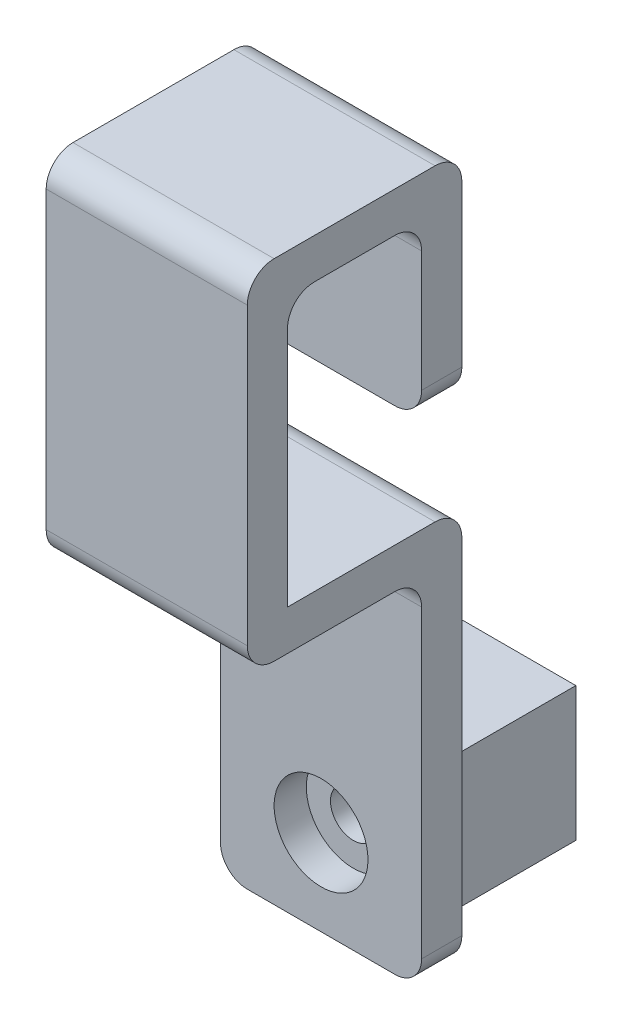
ISO-10303-21;
HEADER;
FILE_DESCRIPTION(('STEP AP214'),'2;1');
FILE_NAME('part.step','',(''),(''),'','','');
FILE_SCHEMA(('AUTOMOTIVE_DESIGN { 1 0 10303 214 1 1 1 1 }'));
ENDSEC;
DATA;
#1=APPLICATION_CONTEXT('core data for automotive mechanical design processes');
#2=APPLICATION_PROTOCOL_DEFINITION('international standard','automotive_design',2000,#1);
#3=PRODUCT_CONTEXT('',#1,'mechanical');
#4=PRODUCT('Part','Part','',(#3));
#5=PRODUCT_RELATED_PRODUCT_CATEGORY('part','',(#4));
#6=PRODUCT_DEFINITION_FORMATION('','',#4);
#7=PRODUCT_DEFINITION_CONTEXT('part definition',#1,'design');
#8=PRODUCT_DEFINITION('design','',#6,#7);
#9=PRODUCT_DEFINITION_SHAPE('','',#8);
#10=(LENGTH_UNIT() NAMED_UNIT(*) SI_UNIT(.MILLI.,.METRE.));
#11=(NAMED_UNIT(*) PLANE_ANGLE_UNIT() SI_UNIT($,.RADIAN.));
#12=(NAMED_UNIT(*) SI_UNIT($,.STERADIAN.) SOLID_ANGLE_UNIT());
#13=UNCERTAINTY_MEASURE_WITH_UNIT(LENGTH_MEASURE(1.E-05),#10,'distance_accuracy_value','');
#14=(GEOMETRIC_REPRESENTATION_CONTEXT(3) GLOBAL_UNCERTAINTY_ASSIGNED_CONTEXT((#13)) GLOBAL_UNIT_ASSIGNED_CONTEXT((#10,
#11,#12)) REPRESENTATION_CONTEXT('',''));
#15=CARTESIAN_POINT('',(0.,0.,0.));
#16=DIRECTION('',(0.,0.,1.));
#17=DIRECTION('',(1.,0.,0.));
#18=AXIS2_PLACEMENT_3D('',#15,#16,#17);
#19=CARTESIAN_POINT('',(7.49999999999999,43.3205159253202,11.));
#20=DIRECTION('',(0.,1.,0.));
#21=DIRECTION('',(0.,0.,1.));
#22=AXIS2_PLACEMENT_3D('',#19,#20,#21);
#23=PLANE('',#22);
#24=DIRECTION('',(0.,0.,1.));
#25=VECTOR('',#24,1.);
#26=CARTESIAN_POINT('',(7.49999999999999,43.3205159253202,11.));
#27=LINE('',#26,#25);
#28=CARTESIAN_POINT('',(7.49999999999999,43.3205159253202,16.));
#29=VERTEX_POINT('',#28);
#30=CARTESIAN_POINT('',(7.49999999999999,43.3205159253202,22.));
#31=VERTEX_POINT('',#30);
#32=EDGE_CURVE('E235',#29,#31,#27,.T.);
#33=ORIENTED_EDGE('',*,*,#32,.T.);
#34=DIRECTION('',(-1.,0.,0.));
#35=VECTOR('',#34,1.);
#36=CARTESIAN_POINT('',(-7.50000000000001,43.3205159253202,22.));
#37=LINE('',#36,#35);
#38=CARTESIAN_POINT('',(-7.50000000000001,43.3205159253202,22.));
#39=VERTEX_POINT('',#38);
#40=EDGE_CURVE('E322',#31,#39,#37,.T.);
#41=ORIENTED_EDGE('',*,*,#40,.T.);
#42=DIRECTION('',(0.,0.,1.));
#43=VECTOR('',#42,1.);
#44=CARTESIAN_POINT('',(-7.50000000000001,43.3205159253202,11.));
#45=LINE('',#44,#43);
#46=CARTESIAN_POINT('',(-7.50000000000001,43.3205159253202,16.));
#47=VERTEX_POINT('',#46);
#48=EDGE_CURVE('E378',#47,#39,#45,.T.);
#49=ORIENTED_EDGE('',*,*,#48,.F.);
#50=DIRECTION('',(-1.,0.,0.));
#51=VECTOR('',#50,1.);
#52=CARTESIAN_POINT('',(7.49999999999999,43.3205159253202,16.));
#53=LINE('',#52,#51);
#54=EDGE_CURVE('E320',#47,#29,#53,.F.);
#55=ORIENTED_EDGE('',*,*,#54,.T.);
#56=EDGE_LOOP('',(#33,#41,#49,#55));
#57=FACE_BOUND('',#56,.T.);
#58=ADVANCED_FACE('F35',(#57),#23,.F.);
#59=CARTESIAN_POINT('',(7.49999999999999,46.3205159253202,24.));
#60=DIRECTION('',(0.,0.,1.));
#61=DIRECTION('',(1.,0.,0.));
#62=AXIS2_PLACEMENT_3D('',#59,#60,#61);
#63=PLANE('',#62);
#64=DIRECTION('',(0.,-1.,0.));
#65=VECTOR('',#64,1.);
#66=CARTESIAN_POINT('',(-7.50000000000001,46.3205159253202,24.));
#67=LINE('',#66,#65);
#68=CARTESIAN_POINT('',(-7.50000000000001,41.3205159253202,24.));
#69=VERTEX_POINT('',#68);
#70=CARTESIAN_POINT('',(-7.50000000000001,23.3205159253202,24.));
#71=VERTEX_POINT('',#70);
#72=EDGE_CURVE('E226',#69,#71,#67,.T.);
#73=ORIENTED_EDGE('',*,*,#72,.F.);
#74=DIRECTION('',(-1.,0.,0.));
#75=VECTOR('',#74,1.);
#76=CARTESIAN_POINT('',(7.49999999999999,41.3205159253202,24.));
#77=LINE('',#76,#75);
#78=CARTESIAN_POINT('',(7.49999999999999,41.3205159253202,24.));
#79=VERTEX_POINT('',#78);
#80=EDGE_CURVE('E222',#69,#79,#77,.F.);
#81=ORIENTED_EDGE('',*,*,#80,.T.);
#82=DIRECTION('',(0.,-1.,0.));
#83=VECTOR('',#82,1.);
#84=CARTESIAN_POINT('',(7.49999999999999,46.3205159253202,24.));
#85=LINE('',#84,#83);
#86=CARTESIAN_POINT('',(7.49999999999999,23.3205159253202,24.));
#87=VERTEX_POINT('',#86);
#88=EDGE_CURVE('E215',#79,#87,#85,.T.);
#89=ORIENTED_EDGE('',*,*,#88,.T.);
#90=DIRECTION('',(-1.,0.,0.));
#91=VECTOR('',#90,1.);
#92=CARTESIAN_POINT('',(7.49999999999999,23.3205159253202,24.));
#93=LINE('',#92,#91);
#94=EDGE_CURVE('E219',#87,#71,#93,.T.);
#95=ORIENTED_EDGE('',*,*,#94,.T.);
#96=EDGE_LOOP('',(#73,#81,#89,#95));
#97=FACE_BOUND('',#96,.T.);
#98=ADVANCED_FACE('F218',(#97),#63,.F.);
#99=CARTESIAN_POINT('',(-7.50000000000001,23.3205159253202,14.));
#100=DIRECTION('',(0.,-1.,0.));
#101=DIRECTION('',(0.,0.,-1.));
#102=AXIS2_PLACEMENT_3D('',#99,#100,#101);
#103=PLANE('',#102);
#104=ORIENTED_EDGE('',*,*,#94,.F.);
#105=DIRECTION('',(0.,0.,-1.));
#106=VECTOR('',#105,1.);
#107=CARTESIAN_POINT('',(7.49999999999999,23.3205159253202,14.));
#108=LINE('',#107,#106);
#109=CARTESIAN_POINT('',(7.49999999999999,23.3205159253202,13.));
#110=VERTEX_POINT('',#109);
#111=EDGE_CURVE('E231',#87,#110,#108,.T.);
#112=ORIENTED_EDGE('',*,*,#111,.T.);
#113=DIRECTION('',(-1.,0.,0.));
#114=VECTOR('',#113,1.);
#115=CARTESIAN_POINT('',(-7.50000000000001,23.3205159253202,13.));
#116=LINE('',#115,#114);
#117=CARTESIAN_POINT('',(-7.50000000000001,23.3205159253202,13.));
#118=VERTEX_POINT('',#117);
#119=EDGE_CURVE('E418',#110,#118,#116,.T.);
#120=ORIENTED_EDGE('',*,*,#119,.T.);
#121=DIRECTION('',(0.,0.,-1.));
#122=VECTOR('',#121,1.);
#123=CARTESIAN_POINT('',(-7.50000000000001,23.3205159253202,14.));
#124=LINE('',#123,#122);
#125=EDGE_CURVE('E233',#71,#118,#124,.T.);
#126=ORIENTED_EDGE('',*,*,#125,.F.);
#127=EDGE_LOOP('',(#104,#112,#120,#126));
#128=FACE_BOUND('',#127,.T.);
#129=ADVANCED_FACE('F229',(#128),#103,.F.);
#130=CARTESIAN_POINT('',(0.,0.,14.));
#131=DIRECTION('',(0.,0.,-1.));
#132=DIRECTION('',(-1.,0.,0.));
#133=AXIS2_PLACEMENT_3D('',#130,#131,#132);
#134=PLANE('',#133);
#135=DIRECTION('',(0.,1.,0.));
#136=VECTOR('',#135,1.);
#137=CARTESIAN_POINT('',(7.5,-6.40117873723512,14.));
#138=LINE('',#137,#136);
#139=CARTESIAN_POINT('',(7.5,-4.40117873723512,14.));
#140=VERTEX_POINT('',#139);
#141=CARTESIAN_POINT('',(7.5,18.3205159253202,14.));
#142=VERTEX_POINT('',#141);
#143=EDGE_CURVE('E247',#140,#142,#138,.T.);
#144=ORIENTED_EDGE('',*,*,#143,.T.);
#145=DIRECTION('',(1.,0.,0.));
#146=VECTOR('',#145,1.);
#147=CARTESIAN_POINT('',(-7.50000000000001,18.3205159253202,14.));
#148=LINE('',#147,#146);
#149=CARTESIAN_POINT('',(-7.5,18.3205159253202,14.));
#150=VERTEX_POINT('',#149);
#151=EDGE_CURVE('E416',#142,#150,#148,.F.);
#152=ORIENTED_EDGE('',*,*,#151,.T.);
#153=DIRECTION('',(0.,-1.,0.));
#154=VECTOR('',#153,1.);
#155=CARTESIAN_POINT('',(-7.5,-6.40117873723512,14.));
#156=LINE('',#155,#154);
#157=CARTESIAN_POINT('',(-7.5,-4.40117873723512,14.));
#158=VERTEX_POINT('',#157);
#159=EDGE_CURVE('E410',#150,#158,#156,.T.);
#160=ORIENTED_EDGE('',*,*,#159,.T.);
#161=CARTESIAN_POINT('',(-5.5,-4.40117873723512,14.));
#162=DIRECTION('',(0.,0.,-1.));
#163=DIRECTION('',(-1.,0.,0.));
#164=AXIS2_PLACEMENT_3D('',#161,#162,#163);
#165=CIRCLE('',#164,2.);
#166=CARTESIAN_POINT('',(-5.5,-6.40117873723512,14.));
#167=VERTEX_POINT('',#166);
#168=EDGE_CURVE('E466',#158,#167,#165,.F.);
#169=ORIENTED_EDGE('',*,*,#168,.T.);
#170=DIRECTION('',(1.,0.,0.));
#171=VECTOR('',#170,1.);
#172=CARTESIAN_POINT('',(-7.5,-6.40117873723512,14.));
#173=LINE('',#172,#171);
#174=CARTESIAN_POINT('',(5.5,-6.40117873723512,14.));
#175=VERTEX_POINT('',#174);
#176=EDGE_CURVE('E407',#167,#175,#173,.T.);
#177=ORIENTED_EDGE('',*,*,#176,.T.);
#178=CARTESIAN_POINT('',(5.5,-4.40117873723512,14.));
#179=DIRECTION('',(0.,0.,-1.));
#180=DIRECTION('',(-1.,0.,0.));
#181=AXIS2_PLACEMENT_3D('',#178,#179,#180);
#182=CIRCLE('',#181,2.);
#183=EDGE_CURVE('E470',#175,#140,#182,.F.);
#184=ORIENTED_EDGE('',*,*,#183,.T.);
#185=EDGE_LOOP('',(#144,#152,#160,#169,#177,#184));
#186=FACE_BOUND('',#185,.T.);
#187=CARTESIAN_POINT('',(0.,0.,14.));
#188=DIRECTION('',(0.,0.,1.));
#189=DIRECTION('',(1.,0.,0.));
#190=AXIS2_PLACEMENT_3D('',#187,#188,#189);
#191=CIRCLE('',#190,3.5);
#192=CARTESIAN_POINT('',(3.5,0.,14.));
#193=VERTEX_POINT('',#192);
#194=EDGE_CURVE('E225',#193,#193,#191,.T.);
#195=ORIENTED_EDGE('',*,*,#194,.F.);
#196=EDGE_LOOP('',(#195));
#197=FACE_BOUND('',#196,.T.);
#198=ADVANCED_FACE('F505',(#186,#197),#134,.F.);
#199=CARTESIAN_POINT('',(5.,5.,11.));
#200=DIRECTION('',(-1.,0.,0.));
#201=DIRECTION('',(0.,-1.,0.));
#202=AXIS2_PLACEMENT_3D('',#199,#200,#201);
#203=PLANE('',#202);
#204=DIRECTION('',(0.,1.,0.));
#205=VECTOR('',#204,1.);
#206=CARTESIAN_POINT('',(5.,5.,0.));
#207=LINE('',#206,#205);
#208=CARTESIAN_POINT('',(5.,-5.,0.));
#209=VERTEX_POINT('',#208);
#210=CARTESIAN_POINT('',(5.,5.,0.));
#211=VERTEX_POINT('',#210);
#212=EDGE_CURVE('E242',#209,#211,#207,.T.);
#213=ORIENTED_EDGE('',*,*,#212,.T.);
#214=DIRECTION('',(0.,0.,-1.));
#215=VECTOR('',#214,1.);
#216=CARTESIAN_POINT('',(5.,5.,11.));
#217=LINE('',#216,#215);
#218=CARTESIAN_POINT('',(5.,5.,11.));
#219=VERTEX_POINT('',#218);
#220=EDGE_CURVE('E277',#219,#211,#217,.T.);
#221=ORIENTED_EDGE('',*,*,#220,.F.);
#222=DIRECTION('',(0.,1.,0.));
#223=VECTOR('',#222,1.);
#224=CARTESIAN_POINT('',(5.,5.,11.));
#225=LINE('',#224,#223);
#226=CARTESIAN_POINT('',(5.,-5.,11.));
#227=VERTEX_POINT('',#226);
#228=EDGE_CURVE('E251',#227,#219,#225,.T.);
#229=ORIENTED_EDGE('',*,*,#228,.F.);
#230=DIRECTION('',(0.,0.,-1.));
#231=VECTOR('',#230,1.);
#232=CARTESIAN_POINT('',(5.,-5.,11.));
#233=LINE('',#232,#231);
#234=EDGE_CURVE('E263',#227,#209,#233,.T.);
#235=ORIENTED_EDGE('',*,*,#234,.T.);
#236=EDGE_LOOP('',(#213,#221,#229,#235));
#237=FACE_BOUND('',#236,.T.);
#238=ADVANCED_FACE('F559',(#237),#203,.F.);
#239=CARTESIAN_POINT('',(-5.,5.,11.));
#240=DIRECTION('',(0.,-1.,0.));
#241=DIRECTION('',(0.,0.,-1.));
#242=AXIS2_PLACEMENT_3D('',#239,#240,#241);
#243=PLANE('',#242);
#244=DIRECTION('',(-1.,0.,0.));
#245=VECTOR('',#244,1.);
#246=CARTESIAN_POINT('',(-5.,5.,0.));
#247=LINE('',#246,#245);
#248=CARTESIAN_POINT('',(-5.,5.,0.));
#249=VERTEX_POINT('',#248);
#250=EDGE_CURVE('E245',#211,#249,#247,.T.);
#251=ORIENTED_EDGE('',*,*,#250,.T.);
#252=DIRECTION('',(0.,0.,-1.));
#253=VECTOR('',#252,1.);
#254=CARTESIAN_POINT('',(-5.,5.,11.));
#255=LINE('',#254,#253);
#256=CARTESIAN_POINT('',(-5.,5.,11.));
#257=VERTEX_POINT('',#256);
#258=EDGE_CURVE('E274',#257,#249,#255,.T.);
#259=ORIENTED_EDGE('',*,*,#258,.F.);
#260=DIRECTION('',(-1.,0.,0.));
#261=VECTOR('',#260,1.);
#262=CARTESIAN_POINT('',(-5.,5.,11.));
#263=LINE('',#262,#261);
#264=EDGE_CURVE('E254',#219,#257,#263,.T.);
#265=ORIENTED_EDGE('',*,*,#264,.F.);
#266=ORIENTED_EDGE('',*,*,#220,.T.);
#267=EDGE_LOOP('',(#251,#259,#265,#266));
#268=FACE_BOUND('',#267,.T.);
#269=ADVANCED_FACE('F718',(#268),#243,.F.);
#270=CARTESIAN_POINT('',(-5.,5.,11.));
#271=DIRECTION('',(1.,0.,0.));
#272=DIRECTION('',(0.,0.,-1.));
#273=AXIS2_PLACEMENT_3D('',#270,#271,#272);
#274=PLANE('',#273);
#275=DIRECTION('',(0.,-1.,0.));
#276=VECTOR('',#275,1.);
#277=CARTESIAN_POINT('',(-5.,5.,0.));
#278=LINE('',#277,#276);
#279=CARTESIAN_POINT('',(-5.,-5.,0.));
#280=VERTEX_POINT('',#279);
#281=EDGE_CURVE('E266',#249,#280,#278,.T.);
#282=ORIENTED_EDGE('',*,*,#281,.T.);
#283=DIRECTION('',(0.,0.,-1.));
#284=VECTOR('',#283,1.);
#285=CARTESIAN_POINT('',(-5.,-5.,11.));
#286=LINE('',#285,#284);
#287=CARTESIAN_POINT('',(-5.,-5.,11.));
#288=VERTEX_POINT('',#287);
#289=EDGE_CURVE('E271',#288,#280,#286,.T.);
#290=ORIENTED_EDGE('',*,*,#289,.F.);
#291=DIRECTION('',(0.,-1.,0.));
#292=VECTOR('',#291,1.);
#293=CARTESIAN_POINT('',(-5.,5.,11.));
#294=LINE('',#293,#292);
#295=EDGE_CURVE('E258',#257,#288,#294,.T.);
#296=ORIENTED_EDGE('',*,*,#295,.F.);
#297=ORIENTED_EDGE('',*,*,#258,.T.);
#298=EDGE_LOOP('',(#282,#290,#296,#297));
#299=FACE_BOUND('',#298,.T.);
#300=ADVANCED_FACE('F722',(#299),#274,.F.);
#301=CARTESIAN_POINT('',(-5.,-5.,11.));
#302=DIRECTION('',(0.,1.,0.));
#303=DIRECTION('',(0.,0.,1.));
#304=AXIS2_PLACEMENT_3D('',#301,#302,#303);
#305=PLANE('',#304);
#306=DIRECTION('',(1.,0.,0.));
#307=VECTOR('',#306,1.);
#308=CARTESIAN_POINT('',(-5.,-5.,0.));
#309=LINE('',#308,#307);
#310=EDGE_CURVE('E255',#280,#209,#309,.T.);
#311=ORIENTED_EDGE('',*,*,#310,.T.);
#312=ORIENTED_EDGE('',*,*,#234,.F.);
#313=DIRECTION('',(1.,0.,0.));
#314=VECTOR('',#313,1.);
#315=CARTESIAN_POINT('',(-5.,-5.,11.));
#316=LINE('',#315,#314);
#317=EDGE_CURVE('E261',#288,#227,#316,.T.);
#318=ORIENTED_EDGE('',*,*,#317,.F.);
#319=ORIENTED_EDGE('',*,*,#289,.T.);
#320=EDGE_LOOP('',(#311,#312,#318,#319));
#321=FACE_BOUND('',#320,.T.);
#322=ADVANCED_FACE('F726',(#321),#305,.F.);
#323=CARTESIAN_POINT('',(0.,0.,0.));
#324=DIRECTION('',(0.,0.,1.));
#325=DIRECTION('',(1.,0.,0.));
#326=AXIS2_PLACEMENT_3D('',#323,#324,#325);
#327=PLANE('',#326);
#328=CARTESIAN_POINT('',(0.,0.,0.));
#329=DIRECTION('',(0.,0.,1.));
#330=DIRECTION('',(1.,0.,0.));
#331=AXIS2_PLACEMENT_3D('',#328,#329,#330);
#332=CIRCLE('',#331,1.7);
#333=CARTESIAN_POINT('',(1.7,0.,0.));
#334=VERTEX_POINT('',#333);
#335=EDGE_CURVE('E397',#334,#334,#332,.T.);
#336=ORIENTED_EDGE('',*,*,#335,.T.);
#337=EDGE_LOOP('',(#336));
#338=FACE_BOUND('',#337,.T.);
#339=ORIENTED_EDGE('',*,*,#212,.F.);
#340=ORIENTED_EDGE('',*,*,#310,.F.);
#341=ORIENTED_EDGE('',*,*,#281,.F.);
#342=ORIENTED_EDGE('',*,*,#250,.F.);
#343=EDGE_LOOP('',(#339,#340,#341,#342));
#344=FACE_BOUND('',#343,.T.);
#345=ADVANCED_FACE('F562',(#338,#344),#327,.F.);
#346=CARTESIAN_POINT('',(0.,0.,11.));
#347=DIRECTION('',(0.,0.,-1.));
#348=DIRECTION('',(-1.,0.,0.));
#349=AXIS2_PLACEMENT_3D('',#346,#347,#348);
#350=PLANE('',#349);
#351=DIRECTION('',(0.,-1.,0.));
#352=VECTOR('',#351,1.);
#353=CARTESIAN_POINT('',(-7.5,-6.40117873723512,11.));
#354=LINE('',#353,#352);
#355=CARTESIAN_POINT('',(-7.50000000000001,21.3205159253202,11.));
#356=VERTEX_POINT('',#355);
#357=CARTESIAN_POINT('',(-7.5,-4.40117873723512,11.));
#358=VERTEX_POINT('',#357);
#359=EDGE_CURVE('E306',#356,#358,#354,.T.);
#360=ORIENTED_EDGE('',*,*,#359,.F.);
#361=DIRECTION('',(-1.,0.,0.));
#362=VECTOR('',#361,1.);
#363=CARTESIAN_POINT('',(7.49999999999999,21.3205159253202,11.));
#364=LINE('',#363,#362);
#365=CARTESIAN_POINT('',(7.49999999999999,21.3205159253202,11.));
#366=VERTEX_POINT('',#365);
#367=EDGE_CURVE('E422',#356,#366,#364,.F.);
#368=ORIENTED_EDGE('',*,*,#367,.T.);
#369=DIRECTION('',(0.,1.,0.));
#370=VECTOR('',#369,1.);
#371=CARTESIAN_POINT('',(7.5,-6.40117873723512,11.));
#372=LINE('',#371,#370);
#373=CARTESIAN_POINT('',(7.5,-4.40117873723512,11.));
#374=VERTEX_POINT('',#373);
#375=EDGE_CURVE('E413',#374,#366,#372,.T.);
#376=ORIENTED_EDGE('',*,*,#375,.F.);
#377=CARTESIAN_POINT('',(5.5,-4.40117873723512,11.));
#378=DIRECTION('',(0.,0.,-1.));
#379=DIRECTION('',(-1.,0.,0.));
#380=AXIS2_PLACEMENT_3D('',#377,#378,#379);
#381=CIRCLE('',#380,2.);
#382=CARTESIAN_POINT('',(5.5,-6.40117873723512,11.));
#383=VERTEX_POINT('',#382);
#384=EDGE_CURVE('E499',#374,#383,#381,.T.);
#385=ORIENTED_EDGE('',*,*,#384,.T.);
#386=DIRECTION('',(1.,0.,0.));
#387=VECTOR('',#386,1.);
#388=CARTESIAN_POINT('',(-7.5,-6.40117873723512,11.));
#389=LINE('',#388,#387);
#390=CARTESIAN_POINT('',(-5.5,-6.40117873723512,11.));
#391=VERTEX_POINT('',#390);
#392=EDGE_CURVE('E481',#391,#383,#389,.T.);
#393=ORIENTED_EDGE('',*,*,#392,.F.);
#394=CARTESIAN_POINT('',(-5.5,-4.40117873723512,11.));
#395=DIRECTION('',(0.,0.,-1.));
#396=DIRECTION('',(-1.,0.,0.));
#397=AXIS2_PLACEMENT_3D('',#394,#395,#396);
#398=CIRCLE('',#397,2.);
#399=EDGE_CURVE('E494',#391,#358,#398,.T.);
#400=ORIENTED_EDGE('',*,*,#399,.T.);
#401=EDGE_LOOP('',(#360,#368,#376,#385,#393,#400));
#402=FACE_BOUND('',#401,.T.);
#403=ORIENTED_EDGE('',*,*,#228,.T.);
#404=ORIENTED_EDGE('',*,*,#264,.T.);
#405=ORIENTED_EDGE('',*,*,#295,.T.);
#406=ORIENTED_EDGE('',*,*,#317,.T.);
#407=EDGE_LOOP('',(#403,#404,#405,#406));
#408=FACE_BOUND('',#407,.T.);
#409=ADVANCED_FACE('F491',(#402,#408),#350,.T.);
#410=CARTESIAN_POINT('',(-7.5,-6.40117873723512,14.));
#411=DIRECTION('',(1.,0.,0.));
#412=DIRECTION('',(0.,1.,0.));
#413=AXIS2_PLACEMENT_3D('',#410,#411,#412);
#414=PLANE('',#413);
#415=DIRECTION('',(0.,1.,0.));
#416=VECTOR('',#415,1.);
#417=CARTESIAN_POINT('',(-7.50000000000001,46.3205159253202,11.));
#418=LINE('',#417,#416);
#419=CARTESIAN_POINT('',(-7.50000000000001,32.3205159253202,11.));
#420=VERTEX_POINT('',#419);
#421=CARTESIAN_POINT('',(-7.50000000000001,44.3205159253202,11.));
#422=VERTEX_POINT('',#421);
#423=EDGE_CURVE('E373',#420,#422,#418,.T.);
#424=ORIENTED_EDGE('',*,*,#423,.F.);
#425=DIRECTION('',(0.,0.,-1.));
#426=VECTOR('',#425,1.);
#427=CARTESIAN_POINT('',(-7.50000000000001,32.3205159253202,14.));
#428=LINE('',#427,#426);
#429=CARTESIAN_POINT('',(-7.50000000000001,32.3205159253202,14.));
#430=VERTEX_POINT('',#429);
#431=EDGE_CURVE('E11',#420,#430,#428,.F.);
#432=ORIENTED_EDGE('',*,*,#431,.T.);
#433=DIRECTION('',(0.,1.,0.));
#434=VECTOR('',#433,1.);
#435=CARTESIAN_POINT('',(-7.50000000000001,30.3205159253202,14.));
#436=LINE('',#435,#434);
#437=CARTESIAN_POINT('',(-7.50000000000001,41.3205159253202,14.));
#438=VERTEX_POINT('',#437);
#439=EDGE_CURVE('E362',#430,#438,#436,.T.);
#440=ORIENTED_EDGE('',*,*,#439,.T.);
#441=CARTESIAN_POINT('',(-7.50000000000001,41.3205159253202,16.));
#442=DIRECTION('',(1.,0.,0.));
#443=DIRECTION('',(0.,1.,0.));
#444=AXIS2_PLACEMENT_3D('',#441,#442,#443);
#445=CIRCLE('',#444,2.);
#446=EDGE_CURVE('E333',#438,#47,#445,.T.);
#447=ORIENTED_EDGE('',*,*,#446,.T.);
#448=ORIENTED_EDGE('',*,*,#48,.T.);
#449=CARTESIAN_POINT('',(-7.50000000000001,41.3205159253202,22.));
#450=DIRECTION('',(1.,0.,0.));
#451=DIRECTION('',(0.,1.,0.));
#452=AXIS2_PLACEMENT_3D('',#449,#450,#451);
#453=CIRCLE('',#452,2.);
#454=EDGE_CURVE('E329',#39,#69,#453,.T.);
#455=ORIENTED_EDGE('',*,*,#454,.T.);
#456=ORIENTED_EDGE('',*,*,#72,.T.);
#457=ORIENTED_EDGE('',*,*,#125,.T.);
#458=CARTESIAN_POINT('',(-7.50000000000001,21.3205159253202,13.));
#459=DIRECTION('',(1.,0.,0.));
#460=DIRECTION('',(0.,1.,0.));
#461=AXIS2_PLACEMENT_3D('',#458,#459,#460);
#462=CIRCLE('',#461,2.);
#463=EDGE_CURVE('E420',#118,#356,#462,.F.);
#464=ORIENTED_EDGE('',*,*,#463,.T.);
#465=ORIENTED_EDGE('',*,*,#359,.T.);
#466=DIRECTION('',(0.,0.,-1.));
#467=VECTOR('',#466,1.);
#468=CARTESIAN_POINT('',(-7.5,-4.40117873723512,14.));
#469=LINE('',#468,#467);
#470=EDGE_CURVE('E474',#358,#158,#469,.F.);
#471=ORIENTED_EDGE('',*,*,#470,.T.);
#472=ORIENTED_EDGE('',*,*,#159,.F.);
#473=CARTESIAN_POINT('',(-7.5,18.3205159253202,16.));
#474=DIRECTION('',(1.,0.,0.));
#475=DIRECTION('',(0.,1.,0.));
#476=AXIS2_PLACEMENT_3D('',#473,#474,#475);
#477=CIRCLE('',#476,2.);
#478=CARTESIAN_POINT('',(-7.50000000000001,20.3205159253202,16.));
#479=VERTEX_POINT('',#478);
#480=EDGE_CURVE('E426',#150,#479,#477,.T.);
#481=ORIENTED_EDGE('',*,*,#480,.T.);
#482=DIRECTION('',(0.,0.,-1.));
#483=VECTOR('',#482,1.);
#484=CARTESIAN_POINT('',(-7.50000000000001,20.3205159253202,27.));
#485=LINE('',#484,#483);
#486=CARTESIAN_POINT('',(-7.50000000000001,20.3205159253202,25.));
#487=VERTEX_POINT('',#486);
#488=EDGE_CURVE('E289',#487,#479,#485,.T.);
#489=ORIENTED_EDGE('',*,*,#488,.F.);
#490=CARTESIAN_POINT('',(-7.50000000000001,22.3205159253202,25.));
#491=DIRECTION('',(1.,0.,0.));
#492=DIRECTION('',(0.,1.,0.));
#493=AXIS2_PLACEMENT_3D('',#490,#491,#492);
#494=CIRCLE('',#493,2.);
#495=CARTESIAN_POINT('',(-7.50000000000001,22.3205159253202,27.));
#496=VERTEX_POINT('',#495);
#497=EDGE_CURVE('E304',#487,#496,#494,.F.);
#498=ORIENTED_EDGE('',*,*,#497,.T.);
#499=DIRECTION('',(0.,-1.,0.));
#500=VECTOR('',#499,1.);
#501=CARTESIAN_POINT('',(-7.50000000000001,23.3205159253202,27.));
#502=LINE('',#501,#500);
#503=CARTESIAN_POINT('',(-7.50000000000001,44.3205159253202,27.));
#504=VERTEX_POINT('',#503);
#505=EDGE_CURVE('E400',#504,#496,#502,.T.);
#506=ORIENTED_EDGE('',*,*,#505,.F.);
#507=CARTESIAN_POINT('',(-7.50000000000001,44.3205159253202,25.));
#508=DIRECTION('',(1.,0.,0.));
#509=DIRECTION('',(0.,1.,0.));
#510=AXIS2_PLACEMENT_3D('',#507,#508,#509);
#511=CIRCLE('',#510,2.);
#512=CARTESIAN_POINT('',(-7.50000000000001,46.3205159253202,25.));
#513=VERTEX_POINT('',#512);
#514=EDGE_CURVE('E308',#504,#513,#511,.F.);
#515=ORIENTED_EDGE('',*,*,#514,.T.);
#516=DIRECTION('',(0.,0.,1.));
#517=VECTOR('',#516,1.);
#518=CARTESIAN_POINT('',(-7.50000000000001,46.3205159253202,27.));
#519=LINE('',#518,#517);
#520=CARTESIAN_POINT('',(-7.50000000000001,46.3205159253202,13.));
#521=VERTEX_POINT('',#520);
#522=EDGE_CURVE('E385',#521,#513,#519,.T.);
#523=ORIENTED_EDGE('',*,*,#522,.F.);
#524=CARTESIAN_POINT('',(-7.50000000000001,44.3205159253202,13.));
#525=DIRECTION('',(1.,0.,0.));
#526=DIRECTION('',(0.,1.,0.));
#527=AXIS2_PLACEMENT_3D('',#524,#525,#526);
#528=CIRCLE('',#527,2.);
#529=EDGE_CURVE('E310',#521,#422,#528,.F.);
#530=ORIENTED_EDGE('',*,*,#529,.T.);
#531=EDGE_LOOP('',(#424,#432,#440,#447,#448,#455,#456,#457,#464,#465,#471,#472,#481,#489,#498,
#506,#515,#523,#530));
#532=FACE_BOUND('',#531,.T.);
#533=ADVANCED_FACE('F443',(#532),#414,.F.);
#534=CARTESIAN_POINT('',(-7.5,-6.40117873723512,14.));
#535=DIRECTION('',(0.,1.,0.));
#536=DIRECTION('',(0.,0.,1.));
#537=AXIS2_PLACEMENT_3D('',#534,#535,#536);
#538=PLANE('',#537);
#539=ORIENTED_EDGE('',*,*,#176,.F.);
#540=DIRECTION('',(0.,0.,-1.));
#541=VECTOR('',#540,1.);
#542=CARTESIAN_POINT('',(-5.5,-6.40117873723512,14.));
#543=LINE('',#542,#541);
#544=EDGE_CURVE('E512',#167,#391,#543,.T.);
#545=ORIENTED_EDGE('',*,*,#544,.T.);
#546=ORIENTED_EDGE('',*,*,#392,.T.);
#547=DIRECTION('',(0.,0.,-1.));
#548=VECTOR('',#547,1.);
#549=CARTESIAN_POINT('',(5.5,-6.40117873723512,14.));
#550=LINE('',#549,#548);
#551=EDGE_CURVE('E280',#383,#175,#550,.F.);
#552=ORIENTED_EDGE('',*,*,#551,.T.);
#553=EDGE_LOOP('',(#539,#545,#546,#552));
#554=FACE_BOUND('',#553,.T.);
#555=ADVANCED_FACE('F517',(#554),#538,.F.);
#556=CARTESIAN_POINT('',(7.5,-6.40117873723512,14.));
#557=DIRECTION('',(-1.,0.,0.));
#558=DIRECTION('',(0.,-1.,0.));
#559=AXIS2_PLACEMENT_3D('',#556,#557,#558);
#560=PLANE('',#559);
#561=DIRECTION('',(0.,1.,0.));
#562=VECTOR('',#561,1.);
#563=CARTESIAN_POINT('',(7.49999999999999,30.3205159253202,14.));
#564=LINE('',#563,#562);
#565=CARTESIAN_POINT('',(7.49999999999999,32.3205159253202,14.));
#566=VERTEX_POINT('',#565);
#567=CARTESIAN_POINT('',(7.49999999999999,41.3205159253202,14.));
#568=VERTEX_POINT('',#567);
#569=EDGE_CURVE('E368',#566,#568,#564,.T.);
#570=ORIENTED_EDGE('',*,*,#569,.F.);
#571=DIRECTION('',(0.,0.,1.));
#572=VECTOR('',#571,1.);
#573=CARTESIAN_POINT('',(7.49999999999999,32.3205159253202,11.));
#574=LINE('',#573,#572);
#575=CARTESIAN_POINT('',(7.49999999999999,32.3205159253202,11.));
#576=VERTEX_POINT('',#575);
#577=EDGE_CURVE('E58',#566,#576,#574,.F.);
#578=ORIENTED_EDGE('',*,*,#577,.T.);
#579=DIRECTION('',(0.,-1.,0.));
#580=VECTOR('',#579,1.);
#581=CARTESIAN_POINT('',(7.49999999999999,46.3205159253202,11.));
#582=LINE('',#581,#580);
#583=CARTESIAN_POINT('',(7.49999999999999,44.3205159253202,11.));
#584=VERTEX_POINT('',#583);
#585=EDGE_CURVE('E354',#584,#576,#582,.T.);
#586=ORIENTED_EDGE('',*,*,#585,.F.);
#587=CARTESIAN_POINT('',(7.49999999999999,44.3205159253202,13.));
#588=DIRECTION('',(-1.,0.,0.));
#589=DIRECTION('',(0.,-1.,0.));
#590=AXIS2_PLACEMENT_3D('',#587,#588,#589);
#591=CIRCLE('',#590,2.);
#592=CARTESIAN_POINT('',(7.49999999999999,46.3205159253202,13.));
#593=VERTEX_POINT('',#592);
#594=EDGE_CURVE('E297',#584,#593,#591,.F.);
#595=ORIENTED_EDGE('',*,*,#594,.T.);
#596=DIRECTION('',(0.,0.,-1.));
#597=VECTOR('',#596,1.);
#598=CARTESIAN_POINT('',(7.49999999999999,46.3205159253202,27.));
#599=LINE('',#598,#597);
#600=CARTESIAN_POINT('',(7.49999999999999,46.3205159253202,25.));
#601=VERTEX_POINT('',#600);
#602=EDGE_CURVE('E234',#601,#593,#599,.T.);
#603=ORIENTED_EDGE('',*,*,#602,.F.);
#604=CARTESIAN_POINT('',(7.49999999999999,44.3205159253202,25.));
#605=DIRECTION('',(-1.,0.,0.));
#606=DIRECTION('',(0.,-1.,0.));
#607=AXIS2_PLACEMENT_3D('',#604,#605,#606);
#608=CIRCLE('',#607,2.);
#609=CARTESIAN_POINT('',(7.49999999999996,44.3205159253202,27.));
#610=VERTEX_POINT('',#609);
#611=EDGE_CURVE('E295',#601,#610,#608,.F.);
#612=ORIENTED_EDGE('',*,*,#611,.T.);
#613=DIRECTION('',(0.,1.,0.));
#614=VECTOR('',#613,1.);
#615=CARTESIAN_POINT('',(7.49999999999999,23.3205159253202,27.));
#616=LINE('',#615,#614);
#617=CARTESIAN_POINT('',(7.5,22.3205159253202,27.));
#618=VERTEX_POINT('',#617);
#619=EDGE_CURVE('E290',#618,#610,#616,.T.);
#620=ORIENTED_EDGE('',*,*,#619,.F.);
#621=CARTESIAN_POINT('',(7.49999999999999,22.3205159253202,25.));
#622=DIRECTION('',(-1.,0.,0.));
#623=DIRECTION('',(0.,-1.,0.));
#624=AXIS2_PLACEMENT_3D('',#621,#622,#623);
#625=CIRCLE('',#624,2.);
#626=CARTESIAN_POINT('',(7.5,20.3205159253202,25.));
#627=VERTEX_POINT('',#626);
#628=EDGE_CURVE('E293',#618,#627,#625,.F.);
#629=ORIENTED_EDGE('',*,*,#628,.T.);
#630=DIRECTION('',(0.,0.,-1.));
#631=VECTOR('',#630,1.);
#632=CARTESIAN_POINT('',(7.5,20.3205159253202,27.));
#633=LINE('',#632,#631);
#634=CARTESIAN_POINT('',(7.5,20.3205159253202,16.));
#635=VERTEX_POINT('',#634);
#636=EDGE_CURVE('E286',#627,#635,#633,.T.);
#637=ORIENTED_EDGE('',*,*,#636,.T.);
#638=CARTESIAN_POINT('',(7.5,18.3205159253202,16.));
#639=DIRECTION('',(-1.,0.,0.));
#640=DIRECTION('',(0.,-1.,0.));
#641=AXIS2_PLACEMENT_3D('',#638,#639,#640);
#642=CIRCLE('',#641,2.);
#643=EDGE_CURVE('E425',#635,#142,#642,.T.);
#644=ORIENTED_EDGE('',*,*,#643,.T.);
#645=ORIENTED_EDGE('',*,*,#143,.F.);
#646=DIRECTION('',(0.,0.,-1.));
#647=VECTOR('',#646,1.);
#648=CARTESIAN_POINT('',(7.5,-4.40117873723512,14.));
#649=LINE('',#648,#647);
#650=EDGE_CURVE('E464',#140,#374,#649,.T.);
#651=ORIENTED_EDGE('',*,*,#650,.T.);
#652=ORIENTED_EDGE('',*,*,#375,.T.);
#653=CARTESIAN_POINT('',(7.49999999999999,21.3205159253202,13.));
#654=DIRECTION('',(-1.,0.,0.));
#655=DIRECTION('',(0.,-1.,0.));
#656=AXIS2_PLACEMENT_3D('',#653,#654,#655);
#657=CIRCLE('',#656,2.);
#658=EDGE_CURVE('E240',#366,#110,#657,.F.);
#659=ORIENTED_EDGE('',*,*,#658,.T.);
#660=ORIENTED_EDGE('',*,*,#111,.F.);
#661=ORIENTED_EDGE('',*,*,#88,.F.);
#662=CARTESIAN_POINT('',(7.49999999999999,41.3205159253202,22.));
#663=DIRECTION('',(-1.,0.,0.));
#664=DIRECTION('',(0.,-1.,0.));
#665=AXIS2_PLACEMENT_3D('',#662,#663,#664);
#666=CIRCLE('',#665,2.);
#667=EDGE_CURVE('E331',#79,#31,#666,.T.);
#668=ORIENTED_EDGE('',*,*,#667,.T.);
#669=ORIENTED_EDGE('',*,*,#32,.F.);
#670=CARTESIAN_POINT('',(7.49999999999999,41.3205159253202,16.));
#671=DIRECTION('',(-1.,0.,0.));
#672=DIRECTION('',(0.,-1.,0.));
#673=AXIS2_PLACEMENT_3D('',#670,#671,#672);
#674=CIRCLE('',#673,2.);
#675=EDGE_CURVE('E335',#29,#568,#674,.T.);
#676=ORIENTED_EDGE('',*,*,#675,.T.);
#677=EDGE_LOOP('',(#570,#578,#586,#595,#603,#612,#620,#629,#637,#644,#645,#651,#652,#659,#660,
#661,#668,#669,#676));
#678=FACE_BOUND('',#677,.T.);
#679=ADVANCED_FACE('F237',(#678),#560,.F.);
#680=CARTESIAN_POINT('',(-7.50000000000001,20.3205159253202,27.));
#681=DIRECTION('',(0.,1.,0.));
#682=DIRECTION('',(0.,0.,1.));
#683=AXIS2_PLACEMENT_3D('',#680,#681,#682);
#684=PLANE('',#683);
#685=ORIENTED_EDGE('',*,*,#636,.F.);
#686=DIRECTION('',(1.,0.,0.));
#687=VECTOR('',#686,1.);
#688=CARTESIAN_POINT('',(-7.50000000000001,20.3205159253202,25.));
#689=LINE('',#688,#687);
#690=EDGE_CURVE('E318',#627,#487,#689,.F.);
#691=ORIENTED_EDGE('',*,*,#690,.T.);
#692=ORIENTED_EDGE('',*,*,#488,.T.);
#693=DIRECTION('',(1.,0.,0.));
#694=VECTOR('',#693,1.);
#695=CARTESIAN_POINT('',(7.5,20.3205159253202,16.));
#696=LINE('',#695,#694);
#697=EDGE_CURVE('E414',#479,#635,#696,.T.);
#698=ORIENTED_EDGE('',*,*,#697,.T.);
#699=EDGE_LOOP('',(#685,#691,#692,#698));
#700=FACE_BOUND('',#699,.T.);
#701=ADVANCED_FACE('F462',(#700),#684,.F.);
#702=CARTESIAN_POINT('',(0.,0.,27.));
#703=DIRECTION('',(0.,0.,1.));
#704=DIRECTION('',(1.,0.,0.));
#705=AXIS2_PLACEMENT_3D('',#702,#703,#704);
#706=PLANE('',#705);
#707=ORIENTED_EDGE('',*,*,#619,.T.);
#708=DIRECTION('',(1.,0.,0.));
#709=VECTOR('',#708,1.);
#710=CARTESIAN_POINT('',(0.,44.3205159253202,27.));
#711=LINE('',#710,#709);
#712=EDGE_CURVE('E316',#610,#504,#711,.F.);
#713=ORIENTED_EDGE('',*,*,#712,.T.);
#714=ORIENTED_EDGE('',*,*,#505,.T.);
#715=DIRECTION('',(1.,0.,0.));
#716=VECTOR('',#715,1.);
#717=CARTESIAN_POINT('',(7.5,22.3205159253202,27.));
#718=LINE('',#717,#716);
#719=EDGE_CURVE('E313',#496,#618,#718,.T.);
#720=ORIENTED_EDGE('',*,*,#719,.T.);
#721=EDGE_LOOP('',(#707,#713,#714,#720));
#722=FACE_BOUND('',#721,.T.);
#723=ADVANCED_FACE('F452',(#722),#706,.T.);
#724=CARTESIAN_POINT('',(0.,0.,14.));
#725=DIRECTION('',(0.,0.,1.));
#726=DIRECTION('',(1.,0.,0.));
#727=AXIS2_PLACEMENT_3D('',#724,#725,#726);
#728=CYLINDRICAL_SURFACE('',#727,1.7);
#729=ORIENTED_EDGE('',*,*,#335,.F.);
#730=EDGE_LOOP('',(#729));
#731=FACE_BOUND('',#730,.T.);
#732=CARTESIAN_POINT('',(0.,0.,11.6));
#733=DIRECTION('',(0.,0.,1.));
#734=DIRECTION('',(1.,0.,0.));
#735=AXIS2_PLACEMENT_3D('',#732,#733,#734);
#736=CIRCLE('',#735,1.70000000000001);
#737=CARTESIAN_POINT('',(1.70000000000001,0.,11.6));
#738=VERTEX_POINT('',#737);
#739=EDGE_CURVE('E394',#738,#738,#736,.T.);
#740=ORIENTED_EDGE('',*,*,#739,.T.);
#741=EDGE_LOOP('',(#740));
#742=FACE_BOUND('',#741,.T.);
#743=ADVANCED_FACE('F548',(#731,#742),#728,.F.);
#744=CARTESIAN_POINT('',(1.70000000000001,0.,11.6));
#745=DIRECTION('',(0.,0.,-1.));
#746=DIRECTION('',(-1.,0.,0.));
#747=AXIS2_PLACEMENT_3D('',#744,#745,#746);
#748=PLANE('',#747);
#749=ORIENTED_EDGE('',*,*,#739,.F.);
#750=EDGE_LOOP('',(#749));
#751=FACE_BOUND('',#750,.T.);
#752=CARTESIAN_POINT('',(0.,0.,11.6));
#753=DIRECTION('',(0.,0.,1.));
#754=DIRECTION('',(1.,0.,0.));
#755=AXIS2_PLACEMENT_3D('',#752,#753,#754);
#756=CIRCLE('',#755,3.5);
#757=CARTESIAN_POINT('',(3.5,0.,11.6));
#758=VERTEX_POINT('',#757);
#759=EDGE_CURVE('E391',#758,#758,#756,.T.);
#760=ORIENTED_EDGE('',*,*,#759,.T.);
#761=EDGE_LOOP('',(#760));
#762=FACE_BOUND('',#761,.T.);
#763=ADVANCED_FACE('F544',(#751,#762),#748,.F.);
#764=CARTESIAN_POINT('',(0.,0.,14.));
#765=DIRECTION('',(0.,0.,1.));
#766=DIRECTION('',(1.,0.,0.));
#767=AXIS2_PLACEMENT_3D('',#764,#765,#766);
#768=CYLINDRICAL_SURFACE('',#767,3.5);
#769=ORIENTED_EDGE('',*,*,#759,.F.);
#770=EDGE_LOOP('',(#769));
#771=FACE_BOUND('',#770,.T.);
#772=ORIENTED_EDGE('',*,*,#194,.T.);
#773=EDGE_LOOP('',(#772));
#774=FACE_BOUND('',#773,.T.);
#775=ADVANCED_FACE('F541',(#771,#774),#768,.F.);
#776=CARTESIAN_POINT('',(-5.5,-4.40117873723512,14.));
#777=DIRECTION('',(0.,0.,-1.));
#778=DIRECTION('',(-1.,0.,0.));
#779=AXIS2_PLACEMENT_3D('',#776,#777,#778);
#780=CYLINDRICAL_SURFACE('',#779,2.);
#781=ORIENTED_EDGE('',*,*,#168,.F.);
#782=ORIENTED_EDGE('',*,*,#470,.F.);
#783=ORIENTED_EDGE('',*,*,#399,.F.);
#784=ORIENTED_EDGE('',*,*,#544,.F.);
#785=EDGE_LOOP('',(#781,#782,#783,#784));
#786=FACE_BOUND('',#785,.T.);
#787=ADVANCED_FACE('F501',(#786),#780,.T.);
#788=CARTESIAN_POINT('',(5.5,-4.40117873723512,14.));
#789=DIRECTION('',(0.,0.,-1.));
#790=DIRECTION('',(-1.,0.,0.));
#791=AXIS2_PLACEMENT_3D('',#788,#789,#790);
#792=CYLINDRICAL_SURFACE('',#791,2.);
#793=ORIENTED_EDGE('',*,*,#183,.F.);
#794=ORIENTED_EDGE('',*,*,#551,.F.);
#795=ORIENTED_EDGE('',*,*,#384,.F.);
#796=ORIENTED_EDGE('',*,*,#650,.F.);
#797=EDGE_LOOP('',(#793,#794,#795,#796));
#798=FACE_BOUND('',#797,.T.);
#799=ADVANCED_FACE('F510',(#798),#792,.T.);
#800=CARTESIAN_POINT('',(-7.50000000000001,18.3205159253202,16.));
#801=DIRECTION('',(-1.,0.,0.));
#802=DIRECTION('',(0.,0.,1.));
#803=AXIS2_PLACEMENT_3D('',#800,#801,#802);
#804=CYLINDRICAL_SURFACE('',#803,2.);
#805=ORIENTED_EDGE('',*,*,#480,.F.);
#806=ORIENTED_EDGE('',*,*,#151,.F.);
#807=ORIENTED_EDGE('',*,*,#643,.F.);
#808=ORIENTED_EDGE('',*,*,#697,.F.);
#809=EDGE_LOOP('',(#805,#806,#807,#808));
#810=FACE_BOUND('',#809,.T.);
#811=ADVANCED_FACE('F504',(#810),#804,.F.);
#812=CARTESIAN_POINT('',(-7.50000000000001,21.3205159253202,13.));
#813=DIRECTION('',(1.,0.,0.));
#814=DIRECTION('',(0.,0.,-1.));
#815=AXIS2_PLACEMENT_3D('',#812,#813,#814);
#816=CYLINDRICAL_SURFACE('',#815,2.);
#817=ORIENTED_EDGE('',*,*,#658,.F.);
#818=ORIENTED_EDGE('',*,*,#367,.F.);
#819=ORIENTED_EDGE('',*,*,#463,.F.);
#820=ORIENTED_EDGE('',*,*,#119,.F.);
#821=EDGE_LOOP('',(#817,#818,#819,#820));
#822=FACE_BOUND('',#821,.T.);
#823=ADVANCED_FACE('F486',(#822),#816,.T.);
#824=CARTESIAN_POINT('',(0.,46.3205159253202,0.));
#825=DIRECTION('',(0.,1.,0.));
#826=DIRECTION('',(0.,0.,1.));
#827=AXIS2_PLACEMENT_3D('',#824,#825,#826);
#828=PLANE('',#827);
#829=ORIENTED_EDGE('',*,*,#602,.T.);
#830=DIRECTION('',(1.,0.,0.));
#831=VECTOR('',#830,1.);
#832=CARTESIAN_POINT('',(0.,46.3205159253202,13.));
#833=LINE('',#832,#831);
#834=EDGE_CURVE('E302',#593,#521,#833,.F.);
#835=ORIENTED_EDGE('',*,*,#834,.T.);
#836=ORIENTED_EDGE('',*,*,#522,.T.);
#837=DIRECTION('',(1.,0.,0.));
#838=VECTOR('',#837,1.);
#839=CARTESIAN_POINT('',(0.,46.3205159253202,25.));
#840=LINE('',#839,#838);
#841=EDGE_CURVE('E299',#513,#601,#840,.T.);
#842=ORIENTED_EDGE('',*,*,#841,.T.);
#843=EDGE_LOOP('',(#829,#835,#836,#842));
#844=FACE_BOUND('',#843,.T.);
#845=ADVANCED_FACE('F439',(#844),#828,.T.);
#846=CARTESIAN_POINT('',(0.,0.,11.));
#847=DIRECTION('',(0.,0.,-1.));
#848=DIRECTION('',(-1.,0.,0.));
#849=AXIS2_PLACEMENT_3D('',#846,#847,#848);
#850=PLANE('',#849);
#851=ORIENTED_EDGE('',*,*,#585,.T.);
#852=CARTESIAN_POINT('',(5.49999999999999,32.3205159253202,11.));
#853=DIRECTION('',(0.,0.,-1.));
#854=DIRECTION('',(-1.,0.,0.));
#855=AXIS2_PLACEMENT_3D('',#852,#853,#854);
#856=CIRCLE('',#855,2.);
#857=CARTESIAN_POINT('',(5.49999999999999,30.3205159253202,11.));
#858=VERTEX_POINT('',#857);
#859=EDGE_CURVE('E43',#576,#858,#856,.T.);
#860=ORIENTED_EDGE('',*,*,#859,.T.);
#861=DIRECTION('',(1.,0.,0.));
#862=VECTOR('',#861,1.);
#863=CARTESIAN_POINT('',(7.49999999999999,30.3205159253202,11.));
#864=LINE('',#863,#862);
#865=CARTESIAN_POINT('',(-5.50000000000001,30.3205159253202,11.));
#866=VERTEX_POINT('',#865);
#867=EDGE_CURVE('E352',#866,#858,#864,.T.);
#868=ORIENTED_EDGE('',*,*,#867,.F.);
#869=CARTESIAN_POINT('',(-5.50000000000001,32.3205159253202,11.));
#870=DIRECTION('',(0.,0.,-1.));
#871=DIRECTION('',(-1.,0.,0.));
#872=AXIS2_PLACEMENT_3D('',#869,#870,#871);
#873=CIRCLE('',#872,2.);
#874=EDGE_CURVE('E50',#866,#420,#873,.T.);
#875=ORIENTED_EDGE('',*,*,#874,.T.);
#876=ORIENTED_EDGE('',*,*,#423,.T.);
#877=DIRECTION('',(1.,0.,0.));
#878=VECTOR('',#877,1.);
#879=CARTESIAN_POINT('',(0.,44.3205159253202,11.));
#880=LINE('',#879,#878);
#881=EDGE_CURVE('E291',#422,#584,#880,.T.);
#882=ORIENTED_EDGE('',*,*,#881,.T.);
#883=EDGE_LOOP('',(#851,#860,#868,#875,#876,#882));
#884=FACE_BOUND('',#883,.T.);
#885=ADVANCED_FACE('F351',(#884),#850,.T.);
#886=CARTESIAN_POINT('',(7.49999999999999,30.3205159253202,14.));
#887=DIRECTION('',(0.,0.,-1.));
#888=DIRECTION('',(-1.,0.,0.));
#889=AXIS2_PLACEMENT_3D('',#886,#887,#888);
#890=PLANE('',#889);
#891=DIRECTION('',(-1.,0.,0.));
#892=VECTOR('',#891,1.);
#893=CARTESIAN_POINT('',(7.49999999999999,30.3205159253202,14.));
#894=LINE('',#893,#892);
#895=CARTESIAN_POINT('',(5.49999999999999,30.3205159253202,14.));
#896=VERTEX_POINT('',#895);
#897=CARTESIAN_POINT('',(-5.50000000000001,30.3205159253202,14.));
#898=VERTEX_POINT('',#897);
#899=EDGE_CURVE('E363',#896,#898,#894,.T.);
#900=ORIENTED_EDGE('',*,*,#899,.F.);
#901=CARTESIAN_POINT('',(5.49999999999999,32.3205159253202,14.));
#902=DIRECTION('',(0.,0.,-1.));
#903=DIRECTION('',(-1.,0.,0.));
#904=AXIS2_PLACEMENT_3D('',#901,#902,#903);
#905=CIRCLE('',#904,2.);
#906=EDGE_CURVE('E346',#896,#566,#905,.F.);
#907=ORIENTED_EDGE('',*,*,#906,.T.);
#908=ORIENTED_EDGE('',*,*,#569,.T.);
#909=DIRECTION('',(-1.,0.,0.));
#910=VECTOR('',#909,1.);
#911=CARTESIAN_POINT('',(-7.50000000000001,41.3205159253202,14.));
#912=LINE('',#911,#910);
#913=EDGE_CURVE('E326',#568,#438,#912,.T.);
#914=ORIENTED_EDGE('',*,*,#913,.T.);
#915=ORIENTED_EDGE('',*,*,#439,.F.);
#916=CARTESIAN_POINT('',(-5.50000000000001,32.3205159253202,14.));
#917=DIRECTION('',(0.,0.,-1.));
#918=DIRECTION('',(-1.,0.,0.));
#919=AXIS2_PLACEMENT_3D('',#916,#917,#918);
#920=CIRCLE('',#919,2.);
#921=EDGE_CURVE('E344',#430,#898,#920,.F.);
#922=ORIENTED_EDGE('',*,*,#921,.T.);
#923=EDGE_LOOP('',(#900,#907,#908,#914,#915,#922));
#924=FACE_BOUND('',#923,.T.);
#925=ADVANCED_FACE('F367',(#924),#890,.F.);
#926=CARTESIAN_POINT('',(0.,30.3205159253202,0.));
#927=DIRECTION('',(0.,-1.,0.));
#928=DIRECTION('',(0.,0.,-1.));
#929=AXIS2_PLACEMENT_3D('',#926,#927,#928);
#930=PLANE('',#929);
#931=ORIENTED_EDGE('',*,*,#867,.T.);
#932=DIRECTION('',(0.,0.,1.));
#933=VECTOR('',#932,1.);
#934=CARTESIAN_POINT('',(5.49999999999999,30.3205159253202,14.));
#935=LINE('',#934,#933);
#936=EDGE_CURVE('E341',#858,#896,#935,.T.);
#937=ORIENTED_EDGE('',*,*,#936,.T.);
#938=ORIENTED_EDGE('',*,*,#899,.T.);
#939=DIRECTION('',(0.,0.,-1.));
#940=VECTOR('',#939,1.);
#941=CARTESIAN_POINT('',(-5.50000000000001,30.3205159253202,11.));
#942=LINE('',#941,#940);
#943=EDGE_CURVE('E338',#898,#866,#942,.T.);
#944=ORIENTED_EDGE('',*,*,#943,.T.);
#945=EDGE_LOOP('',(#931,#937,#938,#944));
#946=FACE_BOUND('',#945,.T.);
#947=ADVANCED_FACE('F358',(#946),#930,.T.);
#948=CARTESIAN_POINT('',(0.,44.3205159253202,13.));
#949=DIRECTION('',(1.,0.,0.));
#950=DIRECTION('',(0.,0.,-1.));
#951=AXIS2_PLACEMENT_3D('',#948,#949,#950);
#952=CYLINDRICAL_SURFACE('',#951,2.);
#953=ORIENTED_EDGE('',*,*,#529,.F.);
#954=ORIENTED_EDGE('',*,*,#834,.F.);
#955=ORIENTED_EDGE('',*,*,#594,.F.);
#956=ORIENTED_EDGE('',*,*,#881,.F.);
#957=EDGE_LOOP('',(#953,#954,#955,#956));
#958=FACE_BOUND('',#957,.T.);
#959=ADVANCED_FACE('F442',(#958),#952,.T.);
#960=CARTESIAN_POINT('',(0.,44.3205159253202,25.));
#961=DIRECTION('',(1.,0.,0.));
#962=DIRECTION('',(0.,0.,-1.));
#963=AXIS2_PLACEMENT_3D('',#960,#961,#962);
#964=CYLINDRICAL_SURFACE('',#963,2.);
#965=ORIENTED_EDGE('',*,*,#514,.F.);
#966=ORIENTED_EDGE('',*,*,#712,.F.);
#967=ORIENTED_EDGE('',*,*,#611,.F.);
#968=ORIENTED_EDGE('',*,*,#841,.F.);
#969=EDGE_LOOP('',(#965,#966,#967,#968));
#970=FACE_BOUND('',#969,.T.);
#971=ADVANCED_FACE('F448',(#970),#964,.T.);
#972=CARTESIAN_POINT('',(0.,22.3205159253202,25.));
#973=DIRECTION('',(-1.,0.,0.));
#974=DIRECTION('',(0.,0.,1.));
#975=AXIS2_PLACEMENT_3D('',#972,#973,#974);
#976=CYLINDRICAL_SURFACE('',#975,2.);
#977=ORIENTED_EDGE('',*,*,#497,.F.);
#978=ORIENTED_EDGE('',*,*,#690,.F.);
#979=ORIENTED_EDGE('',*,*,#628,.F.);
#980=ORIENTED_EDGE('',*,*,#719,.F.);
#981=EDGE_LOOP('',(#977,#978,#979,#980));
#982=FACE_BOUND('',#981,.T.);
#983=ADVANCED_FACE('F456',(#982),#976,.T.);
#984=CARTESIAN_POINT('',(7.49999999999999,41.3205159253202,22.));
#985=DIRECTION('',(1.,0.,0.));
#986=DIRECTION('',(0.,0.,-1.));
#987=AXIS2_PLACEMENT_3D('',#984,#985,#986);
#988=CYLINDRICAL_SURFACE('',#987,2.);
#989=ORIENTED_EDGE('',*,*,#667,.F.);
#990=ORIENTED_EDGE('',*,*,#80,.F.);
#991=ORIENTED_EDGE('',*,*,#454,.F.);
#992=ORIENTED_EDGE('',*,*,#40,.F.);
#993=EDGE_LOOP('',(#989,#990,#991,#992));
#994=FACE_BOUND('',#993,.T.);
#995=ADVANCED_FACE('F633',(#994),#988,.F.);
#996=CARTESIAN_POINT('',(7.49999999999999,41.3205159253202,16.));
#997=DIRECTION('',(1.,0.,0.));
#998=DIRECTION('',(0.,0.,-1.));
#999=AXIS2_PLACEMENT_3D('',#996,#997,#998);
#1000=CYLINDRICAL_SURFACE('',#999,2.);
#1001=ORIENTED_EDGE('',*,*,#675,.F.);
#1002=ORIENTED_EDGE('',*,*,#54,.F.);
#1003=ORIENTED_EDGE('',*,*,#446,.F.);
#1004=ORIENTED_EDGE('',*,*,#913,.F.);
#1005=EDGE_LOOP('',(#1001,#1002,#1003,#1004));
#1006=FACE_BOUND('',#1005,.T.);
#1007=ADVANCED_FACE('F642',(#1006),#1000,.F.);
#1008=CARTESIAN_POINT('',(5.49999999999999,32.3205159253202,0.));
#1009=DIRECTION('',(0.,0.,-1.));
#1010=DIRECTION('',(-1.,0.,0.));
#1011=AXIS2_PLACEMENT_3D('',#1008,#1009,#1010);
#1012=CYLINDRICAL_SURFACE('',#1011,2.);
#1013=ORIENTED_EDGE('',*,*,#859,.F.);
#1014=ORIENTED_EDGE('',*,*,#577,.F.);
#1015=ORIENTED_EDGE('',*,*,#906,.F.);
#1016=ORIENTED_EDGE('',*,*,#936,.F.);
#1017=EDGE_LOOP('',(#1013,#1014,#1015,#1016));
#1018=FACE_BOUND('',#1017,.T.);
#1019=ADVANCED_FACE('F365',(#1018),#1012,.T.);
#1020=CARTESIAN_POINT('',(-5.50000000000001,32.3205159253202,0.));
#1021=DIRECTION('',(0.,0.,1.));
#1022=DIRECTION('',(1.,0.,0.));
#1023=AXIS2_PLACEMENT_3D('',#1020,#1021,#1022);
#1024=CYLINDRICAL_SURFACE('',#1023,2.);
#1025=ORIENTED_EDGE('',*,*,#921,.F.);
#1026=ORIENTED_EDGE('',*,*,#431,.F.);
#1027=ORIENTED_EDGE('',*,*,#874,.F.);
#1028=ORIENTED_EDGE('',*,*,#943,.F.);
#1029=EDGE_LOOP('',(#1025,#1026,#1027,#1028));
#1030=FACE_BOUND('',#1029,.T.);
#1031=ADVANCED_FACE('F37',(#1030),#1024,.T.);
#1032=CLOSED_SHELL('',(#58,#98,#129,#198,#238,#269,#300,#322,#345,#409,#533,#555,#679,#701,#723,
#743,#763,#775,#787,#799,#811,#823,#845,#885,#925,#947,#959,#971,#983,#995,#1007,#1019,#1031));
#1033=MANIFOLD_SOLID_BREP('B2',#1032);
#1034=ADVANCED_BREP_SHAPE_REPRESENTATION('',(#18,#1033),#14);
#1035=SHAPE_DEFINITION_REPRESENTATION(#9,#1034);
ENDSEC;
END-ISO-10303-21;
